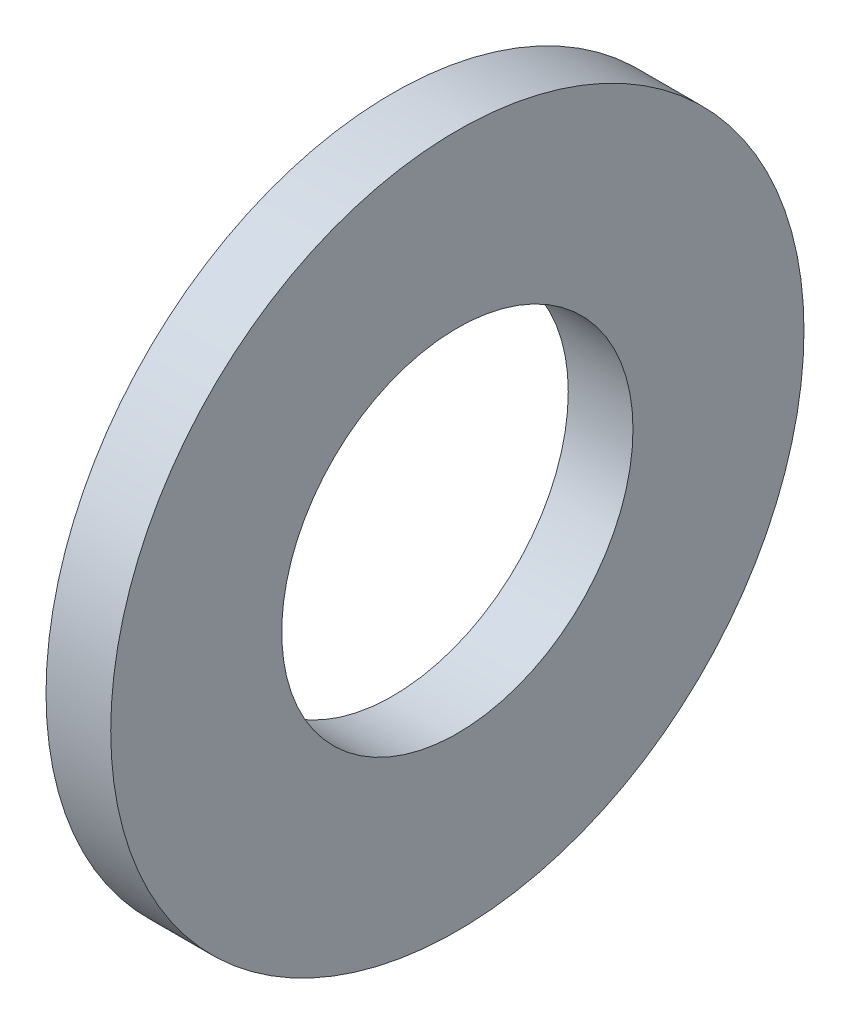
ISO-10303-21;
HEADER;
FILE_DESCRIPTION(('STEP AP214'),'2;1');
FILE_NAME('part.step','',(''),(''),'','','');
FILE_SCHEMA(('AUTOMOTIVE_DESIGN { 1 0 10303 214 1 1 1 1 }'));
ENDSEC;
DATA;
#1=APPLICATION_CONTEXT('core data for automotive mechanical design processes');
#2=APPLICATION_PROTOCOL_DEFINITION('international standard','automotive_design',2000,#1);
#3=PRODUCT_CONTEXT('',#1,'mechanical');
#4=PRODUCT('Part','Part','',(#3));
#5=PRODUCT_RELATED_PRODUCT_CATEGORY('part','',(#4));
#6=PRODUCT_DEFINITION_FORMATION('','',#4);
#7=PRODUCT_DEFINITION_CONTEXT('part definition',#1,'design');
#8=PRODUCT_DEFINITION('design','',#6,#7);
#9=PRODUCT_DEFINITION_SHAPE('','',#8);
#10=(LENGTH_UNIT() NAMED_UNIT(*) SI_UNIT(.MILLI.,.METRE.));
#11=(NAMED_UNIT(*) PLANE_ANGLE_UNIT() SI_UNIT($,.RADIAN.));
#12=(NAMED_UNIT(*) SI_UNIT($,.STERADIAN.) SOLID_ANGLE_UNIT());
#13=UNCERTAINTY_MEASURE_WITH_UNIT(LENGTH_MEASURE(1.E-05),#10,'distance_accuracy_value','');
#14=(GEOMETRIC_REPRESENTATION_CONTEXT(3) GLOBAL_UNCERTAINTY_ASSIGNED_CONTEXT((#13)) GLOBAL_UNIT_ASSIGNED_CONTEXT((#10,
#11,#12)) REPRESENTATION_CONTEXT('',''));
#15=CARTESIAN_POINT('',(0.,0.,0.));
#16=DIRECTION('',(0.,0.,1.));
#17=DIRECTION('',(1.,0.,0.));
#18=AXIS2_PLACEMENT_3D('',#15,#16,#17);
#19=CARTESIAN_POINT('',(1.778,0.,0.));
#20=DIRECTION('',(1.,0.,0.));
#21=DIRECTION('',(0.,0.,-1.));
#22=AXIS2_PLACEMENT_3D('',#19,#20,#21);
#23=PLANE('',#22);
#24=CARTESIAN_POINT('',(1.778,0.,0.));
#25=DIRECTION('',(1.,0.,0.));
#26=DIRECTION('',(0.,0.,-1.));
#27=AXIS2_PLACEMENT_3D('',#24,#25,#26);
#28=CIRCLE('',#27,9.525);
#29=CARTESIAN_POINT('',(1.778,0.,-9.525));
#30=VERTEX_POINT('',#29);
#31=EDGE_CURVE('E10',#30,#30,#28,.T.);
#32=ORIENTED_EDGE('',*,*,#31,.T.);
#33=EDGE_LOOP('',(#32));
#34=FACE_BOUND('',#33,.T.);
#35=CARTESIAN_POINT('',(1.778,0.,0.));
#36=DIRECTION('',(1.,0.,0.));
#37=DIRECTION('',(0.,0.,-1.));
#38=AXIS2_PLACEMENT_3D('',#35,#36,#37);
#39=CIRCLE('',#38,4.826);
#40=CARTESIAN_POINT('',(1.778,0.,-4.826));
#41=VERTEX_POINT('',#40);
#42=EDGE_CURVE('E47',#41,#41,#39,.T.);
#43=ORIENTED_EDGE('',*,*,#42,.F.);
#44=EDGE_LOOP('',(#43));
#45=FACE_BOUND('',#44,.T.);
#46=ADVANCED_FACE('F36',(#34,#45),#23,.T.);
#47=CARTESIAN_POINT('',(0.,0.,0.));
#48=DIRECTION('',(1.,0.,0.));
#49=DIRECTION('',(0.,0.,-1.));
#50=AXIS2_PLACEMENT_3D('',#47,#48,#49);
#51=PLANE('',#50);
#52=CARTESIAN_POINT('',(0.,0.,0.));
#53=DIRECTION('',(1.,0.,0.));
#54=DIRECTION('',(0.,0.,-1.));
#55=AXIS2_PLACEMENT_3D('',#52,#53,#54);
#56=CIRCLE('',#55,9.525);
#57=CARTESIAN_POINT('',(0.,0.,-9.525));
#58=VERTEX_POINT('',#57);
#59=EDGE_CURVE('E40',#58,#58,#56,.T.);
#60=ORIENTED_EDGE('',*,*,#59,.F.);
#61=EDGE_LOOP('',(#60));
#62=FACE_BOUND('',#61,.T.);
#63=CARTESIAN_POINT('',(0.,0.,0.));
#64=DIRECTION('',(1.,0.,0.));
#65=DIRECTION('',(0.,0.,-1.));
#66=AXIS2_PLACEMENT_3D('',#63,#64,#65);
#67=CIRCLE('',#66,4.826);
#68=CARTESIAN_POINT('',(0.,0.,-4.826));
#69=VERTEX_POINT('',#68);
#70=EDGE_CURVE('E49',#69,#69,#67,.T.);
#71=ORIENTED_EDGE('',*,*,#70,.T.);
#72=EDGE_LOOP('',(#71));
#73=FACE_BOUND('',#72,.T.);
#74=ADVANCED_FACE('F59',(#62,#73),#51,.F.);
#75=CARTESIAN_POINT('',(1.778,0.,0.));
#76=DIRECTION('',(-1.,0.,0.));
#77=DIRECTION('',(0.,0.,1.));
#78=AXIS2_PLACEMENT_3D('',#75,#76,#77);
#79=CYLINDRICAL_SURFACE('',#78,9.525);
#80=ORIENTED_EDGE('',*,*,#31,.F.);
#81=EDGE_LOOP('',(#80));
#82=FACE_BOUND('',#81,.T.);
#83=ORIENTED_EDGE('',*,*,#59,.T.);
#84=EDGE_LOOP('',(#83));
#85=FACE_BOUND('',#84,.T.);
#86=ADVANCED_FACE('F38',(#82,#85),#79,.T.);
#87=CARTESIAN_POINT('',(1.778,0.,0.));
#88=DIRECTION('',(-1.,0.,0.));
#89=DIRECTION('',(0.,0.,1.));
#90=AXIS2_PLACEMENT_3D('',#87,#88,#89);
#91=CYLINDRICAL_SURFACE('',#90,4.826);
#92=ORIENTED_EDGE('',*,*,#42,.T.);
#93=EDGE_LOOP('',(#92));
#94=FACE_BOUND('',#93,.T.);
#95=ORIENTED_EDGE('',*,*,#70,.F.);
#96=EDGE_LOOP('',(#95));
#97=FACE_BOUND('',#96,.T.);
#98=ADVANCED_FACE('F55',(#94,#97),#91,.F.);
#99=CLOSED_SHELL('',(#46,#74,#86,#98));
#100=MANIFOLD_SOLID_BREP('B2',#99);
#101=ADVANCED_BREP_SHAPE_REPRESENTATION('',(#18,#100),#14);
#102=SHAPE_DEFINITION_REPRESENTATION(#9,#101);
ENDSEC;
END-ISO-10303-21;
